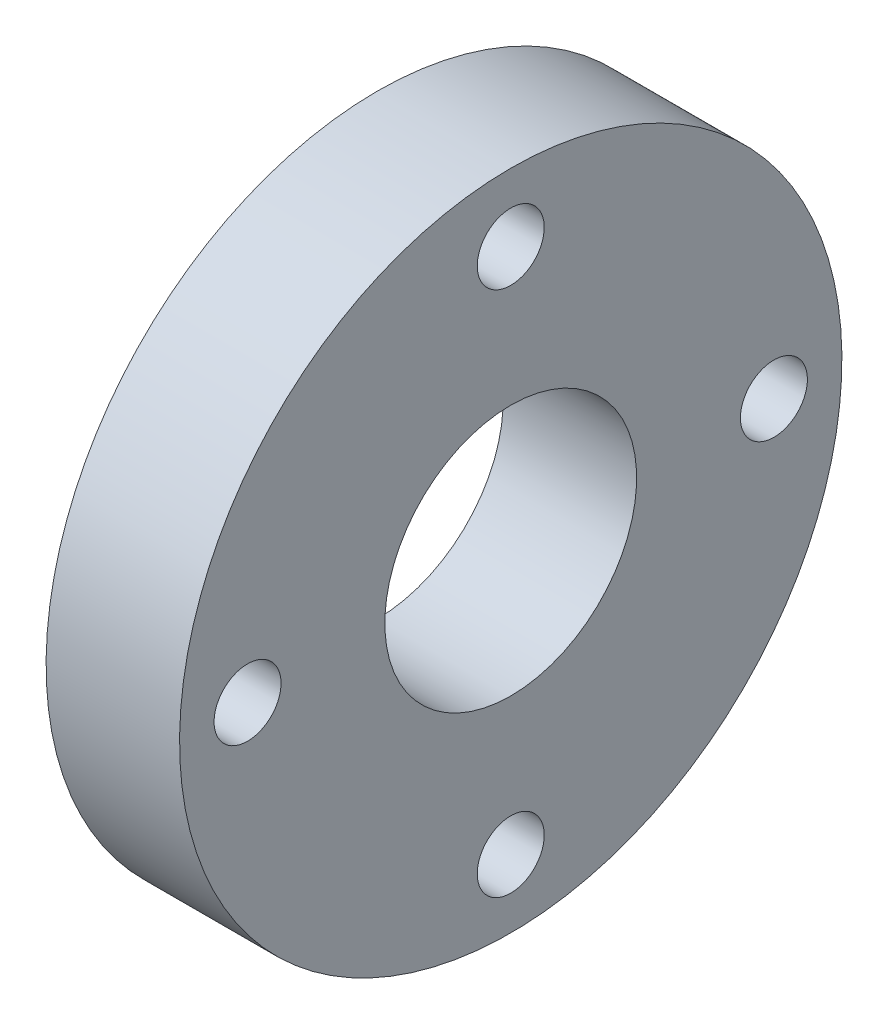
from build123d import *

# Parameters (mm, degrees)
SKETCH1_W          = 13.462
SKETCH1_H          = 20.701
CUT_EXTRUDE1_REACH = 51.117
SKETCH2_R          = 3.3782
CIRPATTERN1_COUNT  = 4


with BuildPart() as part:
    # Sketch1 → Base-Revolve (revolve)
    with BuildSketch(Plane.XZ, mode=Mode.PRIVATE) as base_revolve_sk:
        with Locations((-6.731, -23.0505)):
            Rectangle(SKETCH1_W, SKETCH1_H)
    revolve(base_revolve_sk.sketch.rotate(Axis((0, 0, 0), (-1, 0, 0)), 270), axis=Axis((0, 0, 0), (-1, 0, 0)))

    # Sketch2 → Cut-Extrude1 (cut, up to next)
    with BuildSketch(Plane.ZY.offset(13.462), mode=Mode.PRIVATE) as cut_extrude1_sk1:
        with Locations((-26.543, 0)):
            Circle(SKETCH2_R)
    cut_extrude1_tool1 = extrude(cut_extrude1_sk1.sketch, amount=-CUT_EXTRUDE1_REACH, mode=Mode.PRIVATE) & part.part
    cut_extrude1 = cut_extrude1_tool1.solids().sort_by_distance((-13.462, 0, -26.543))[0]
    add(cut_extrude1, mode=Mode.SUBTRACT)

    # CirPattern1: Cut-Extrude1 ×4 about axis
    cirpattern1_axis = Axis((0, 0, 0), (1, 0, 0))
    for i in range(1, CIRPATTERN1_COUNT):
        add(cut_extrude1.rotate(cirpattern1_axis, i * 360 / CIRPATTERN1_COUNT), mode=Mode.SUBTRACT)


solid = part.part
